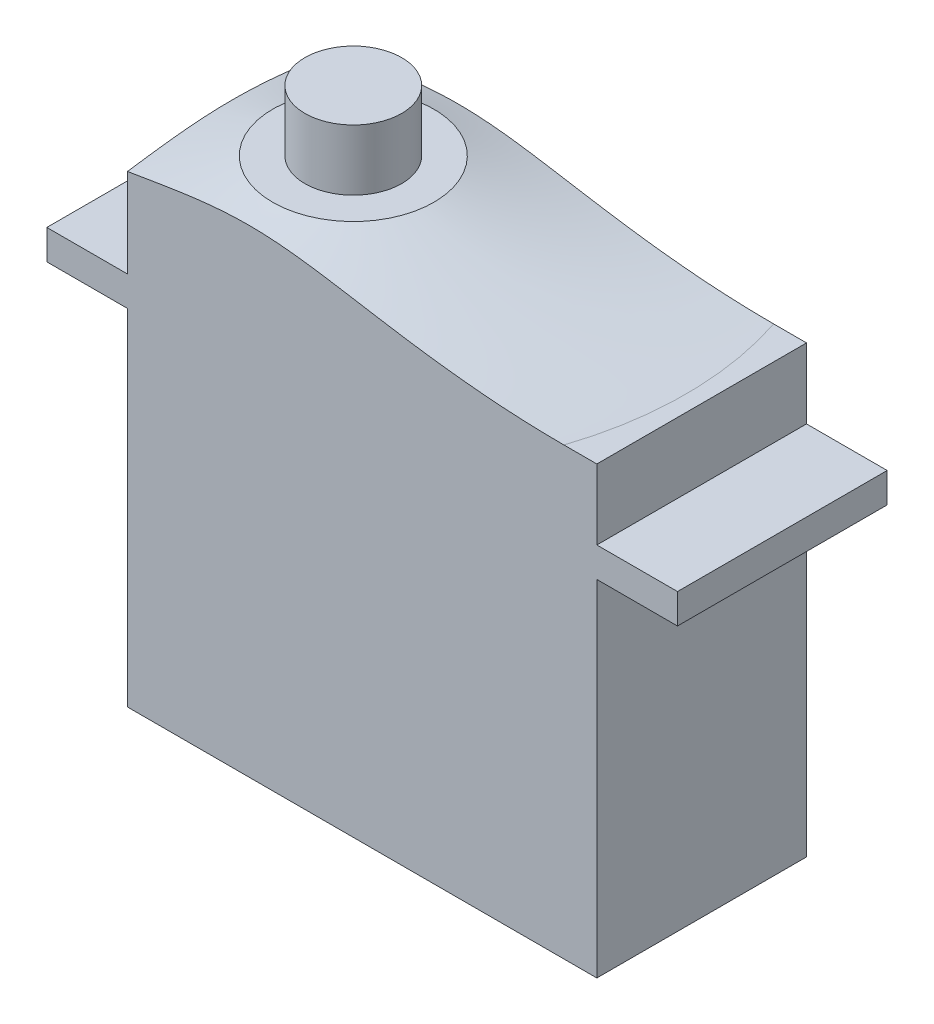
ISO-10303-21;
HEADER;
FILE_DESCRIPTION(('STEP AP214'),'2;1');
FILE_NAME('part.step','',(''),(''),'','','');
FILE_SCHEMA(('AUTOMOTIVE_DESIGN { 1 0 10303 214 1 1 1 1 }'));
ENDSEC;
DATA;
#1=APPLICATION_CONTEXT('core data for automotive mechanical design processes');
#2=APPLICATION_PROTOCOL_DEFINITION('international standard','automotive_design',2000,#1);
#3=PRODUCT_CONTEXT('',#1,'mechanical');
#4=PRODUCT('Part','Part','',(#3));
#5=PRODUCT_RELATED_PRODUCT_CATEGORY('part','',(#4));
#6=PRODUCT_DEFINITION_FORMATION('','',#4);
#7=PRODUCT_DEFINITION_CONTEXT('part definition',#1,'design');
#8=PRODUCT_DEFINITION('design','',#6,#7);
#9=PRODUCT_DEFINITION_SHAPE('','',#8);
#10=(LENGTH_UNIT() NAMED_UNIT(*) SI_UNIT(.MILLI.,.METRE.));
#11=(NAMED_UNIT(*) PLANE_ANGLE_UNIT() SI_UNIT($,.RADIAN.));
#12=(NAMED_UNIT(*) SI_UNIT($,.STERADIAN.) SOLID_ANGLE_UNIT());
#13=UNCERTAINTY_MEASURE_WITH_UNIT(LENGTH_MEASURE(1.E-05),#10,'distance_accuracy_value','');
#14=(GEOMETRIC_REPRESENTATION_CONTEXT(3) GLOBAL_UNCERTAINTY_ASSIGNED_CONTEXT((#13)) GLOBAL_UNIT_ASSIGNED_CONTEXT((#10,
#11,#12)) REPRESENTATION_CONTEXT('',''));
#15=CARTESIAN_POINT('',(0.,0.,0.));
#16=DIRECTION('',(0.,0.,1.));
#17=DIRECTION('',(1.,0.,0.));
#18=AXIS2_PLACEMENT_3D('',#15,#16,#17);
#19=CARTESIAN_POINT('',(0.,27.6,0.));
#20=DIRECTION('',(1.,0.,0.));
#21=DIRECTION('',(0.,0.,-1.));
#22=AXIS2_PLACEMENT_3D('',#19,#20,#21);
#23=PLANE('',#22);
#24=DIRECTION('',(0.,0.,1.));
#25=VECTOR('',#24,1.);
#26=CARTESIAN_POINT('',(0.,21.4,13.));
#27=LINE('',#26,#25);
#28=CARTESIAN_POINT('',(0.,21.4,0.));
#29=VERTEX_POINT('',#28);
#30=CARTESIAN_POINT('',(0.,21.4,13.));
#31=VERTEX_POINT('',#30);
#32=EDGE_CURVE('E150',#29,#31,#27,.T.);
#33=ORIENTED_EDGE('',*,*,#32,.F.);
#34=DIRECTION('',(0.,-1.,0.));
#35=VECTOR('',#34,1.);
#36=CARTESIAN_POINT('',(0.,27.6,0.));
#37=LINE('',#36,#35);
#38=CARTESIAN_POINT('',(0.,0.,0.));
#39=VERTEX_POINT('',#38);
#40=EDGE_CURVE('E195',#29,#39,#37,.T.);
#41=ORIENTED_EDGE('',*,*,#40,.T.);
#42=DIRECTION('',(0.,0.,1.));
#43=VECTOR('',#42,1.);
#44=CARTESIAN_POINT('',(0.,0.,0.));
#45=LINE('',#44,#43);
#46=CARTESIAN_POINT('',(0.,0.,13.));
#47=VERTEX_POINT('',#46);
#48=EDGE_CURVE('E186',#39,#47,#45,.T.);
#49=ORIENTED_EDGE('',*,*,#48,.T.);
#50=DIRECTION('',(0.,-1.,0.));
#51=VECTOR('',#50,1.);
#52=CARTESIAN_POINT('',(0.,27.6,13.));
#53=LINE('',#52,#51);
#54=EDGE_CURVE('E213',#31,#47,#53,.T.);
#55=ORIENTED_EDGE('',*,*,#54,.F.);
#56=EDGE_LOOP('',(#33,#41,#49,#55));
#57=FACE_BOUND('',#56,.T.);
#58=ADVANCED_FACE('F32',(#57),#23,.F.);
#59=DIRECTION('',(0.,0.,-1.));
#60=VECTOR('',#59,1.);
#61=CARTESIAN_POINT('',(0.,23.25,13.));
#62=LINE('',#61,#60);
#63=CARTESIAN_POINT('',(0.,23.25,13.));
#64=VERTEX_POINT('',#63);
#65=CARTESIAN_POINT('',(0.,23.25,0.));
#66=VERTEX_POINT('',#65);
#67=EDGE_CURVE('E244',#64,#66,#62,.T.);
#68=ORIENTED_EDGE('',*,*,#67,.F.);
#69=CARTESIAN_POINT('',(0.,28.7556411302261,13.));
#70=VERTEX_POINT('',#69);
#71=EDGE_CURVE('E58',#70,#64,#53,.T.);
#72=ORIENTED_EDGE('',*,*,#71,.F.);
#73=CARTESIAN_POINT('',(0.,28.7556411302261,13.));
#74=CARTESIAN_POINT('',(0.,28.7857035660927,12.7901635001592));
#75=CARTESIAN_POINT('',(0.,28.8155636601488,12.5802963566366));
#76=CARTESIAN_POINT('',(0.,28.8744237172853,12.1604329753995));
#77=CARTESIAN_POINT('',(0.,28.9034236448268,11.950436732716));
#78=CARTESIAN_POINT('',(0.,28.9601264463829,11.5301083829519));
#79=CARTESIAN_POINT('',(0.,28.9878283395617,11.3197761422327));
#80=CARTESIAN_POINT('',(0.,29.0413944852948,10.8988804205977));
#81=CARTESIAN_POINT('',(0.,29.0672587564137,10.6883169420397));
#82=CARTESIAN_POINT('',(0.,29.141272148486,10.0562491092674));
#83=CARTESIAN_POINT('',(0.,29.1858495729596,9.63431221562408));
#84=CARTESIAN_POINT('',(0.,29.2608840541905,8.7892397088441));
#85=CARTESIAN_POINT('',(0.,29.2913450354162,8.36610446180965));
#86=CARTESIAN_POINT('',(0.,29.3235052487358,7.73272580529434));
#87=CARTESIAN_POINT('',(0.,29.3319614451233,7.52281839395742));
#88=CARTESIAN_POINT('',(0.,29.3442110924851,7.1028646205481));
#89=CARTESIAN_POINT('',(0.,29.3480045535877,6.89281825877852));
#90=CARTESIAN_POINT('',(0.,29.3507860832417,6.47268395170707));
#91=CARTESIAN_POINT('',(0.,29.3497739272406,6.26259600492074));
#92=CARTESIAN_POINT('',(0.,29.3429822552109,5.84249786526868));
#93=CARTESIAN_POINT('',(0.,29.3372027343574,5.63248767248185));
#94=CARTESIAN_POINT('',(0.,29.3210859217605,5.21277980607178));
#95=CARTESIAN_POINT('',(0.,29.3107515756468,5.00308201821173));
#96=CARTESIAN_POINT('',(0.,29.2858772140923,4.58393376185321));
#97=CARTESIAN_POINT('',(0.,29.2713370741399,4.37448330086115));
#98=CARTESIAN_POINT('',(0.,29.2220820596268,3.7465824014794));
#99=CARTESIAN_POINT('',(0.,29.1817321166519,3.32857127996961));
#100=CARTESIAN_POINT('',(0.,29.1094233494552,2.66833941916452));
#101=CARTESIAN_POINT('',(0.,29.0810120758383,2.42570869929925));
#102=CARTESIAN_POINT('',(0.,29.0214251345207,1.94079407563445));
#103=CARTESIAN_POINT('',(0.,28.9902495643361,1.69851015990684));
#104=CARTESIAN_POINT('',(0.,28.9258395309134,1.2134199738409));
#105=CARTESIAN_POINT('',(0.,28.8925987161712,0.970614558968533));
#106=CARTESIAN_POINT('',(0.,28.8248730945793,0.485192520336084));
#107=CARTESIAN_POINT('',(0.,28.790388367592,0.242575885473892));
#108=CARTESIAN_POINT('',(0.,28.7556411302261,0.));
#109=B_SPLINE_CURVE_WITH_KNOTS('',3,(#73,#74,#75,#76,#77,#78,#79,#80,#81,#82,#83,#84,#85,#86,
#87,#88,#89,#90,#91,#92,#93,#94,#95,#96,#97,#98,#99,#100,#101,#102,#103,#104,#105,#106,#107,
#108),.UNSPECIFIED.,.F.,.F.,(4,2,2,2,2,2,2,2,2,2,2,2,2,2,2,2,2,4),(0.,0.635939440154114,
1.27190511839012,1.90834384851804,2.54477614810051,3.81747373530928,5.08981729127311,
5.72000540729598,6.35019215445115,6.9804083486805,7.6106251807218,8.24043504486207,
8.87026355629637,10.1298870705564,10.862742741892,11.5955725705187,12.3307799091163,
13.0659401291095),.UNSPECIFIED.);
#110=CARTESIAN_POINT('',(0.,28.7556411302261,0.));
#111=VERTEX_POINT('',#110);
#112=EDGE_CURVE('E45',#70,#111,#109,.T.);
#113=ORIENTED_EDGE('',*,*,#112,.T.);
#114=EDGE_CURVE('E51',#111,#66,#37,.T.);
#115=ORIENTED_EDGE('',*,*,#114,.T.);
#116=EDGE_LOOP('',(#68,#72,#113,#115));
#117=FACE_BOUND('',#116,.T.);
#118=ADVANCED_FACE('F234',(#117),#23,.F.);
#119=CARTESIAN_POINT('',(29.1,27.6,0.));
#120=DIRECTION('',(1.,0.,0.));
#121=DIRECTION('',(0.,0.,-1.));
#122=AXIS2_PLACEMENT_3D('',#119,#120,#121);
#123=PLANE('',#122);
#124=DIRECTION('',(0.,0.,1.));
#125=VECTOR('',#124,1.);
#126=CARTESIAN_POINT('',(29.1,23.25,13.));
#127=LINE('',#126,#125);
#128=CARTESIAN_POINT('',(29.1,23.25,0.));
#129=VERTEX_POINT('',#128);
#130=CARTESIAN_POINT('',(29.1,23.25,13.));
#131=VERTEX_POINT('',#130);
#132=EDGE_CURVE('E157',#129,#131,#127,.T.);
#133=ORIENTED_EDGE('',*,*,#132,.F.);
#134=DIRECTION('',(0.,-1.,0.));
#135=VECTOR('',#134,1.);
#136=CARTESIAN_POINT('',(29.1,27.6,0.));
#137=LINE('',#136,#135);
#138=CARTESIAN_POINT('',(29.1,27.6,0.));
#139=VERTEX_POINT('',#138);
#140=EDGE_CURVE('E207',#139,#129,#137,.T.);
#141=ORIENTED_EDGE('',*,*,#140,.F.);
#142=DIRECTION('',(0.,0.,1.));
#143=VECTOR('',#142,1.);
#144=CARTESIAN_POINT('',(29.1,27.6,0.));
#145=LINE('',#144,#143);
#146=CARTESIAN_POINT('',(29.1,27.6,13.));
#147=VERTEX_POINT('',#146);
#148=EDGE_CURVE('E189',#139,#147,#145,.T.);
#149=ORIENTED_EDGE('',*,*,#148,.T.);
#150=DIRECTION('',(0.,-1.,0.));
#151=VECTOR('',#150,1.);
#152=CARTESIAN_POINT('',(29.1,27.6,13.));
#153=LINE('',#152,#151);
#154=EDGE_CURVE('E211',#147,#131,#153,.T.);
#155=ORIENTED_EDGE('',*,*,#154,.T.);
#156=EDGE_LOOP('',(#133,#141,#149,#155));
#157=FACE_BOUND('',#156,.T.);
#158=ADVANCED_FACE('F231',(#157),#123,.T.);
#159=CARTESIAN_POINT('',(0.,27.6,13.));
#160=DIRECTION('',(0.,0.,-1.));
#161=DIRECTION('',(-1.,0.,0.));
#162=AXIS2_PLACEMENT_3D('',#159,#160,#161);
#163=PLANE('',#162);
#164=DIRECTION('',(1.,0.,0.));
#165=VECTOR('',#164,1.);
#166=CARTESIAN_POINT('',(0.,0.,13.));
#167=LINE('',#166,#165);
#168=CARTESIAN_POINT('',(29.1,0.,13.));
#169=VERTEX_POINT('',#168);
#170=EDGE_CURVE('E198',#47,#169,#167,.T.);
#171=ORIENTED_EDGE('',*,*,#170,.T.);
#172=CARTESIAN_POINT('',(29.1,21.4,13.));
#173=VERTEX_POINT('',#172);
#174=EDGE_CURVE('E210',#173,#169,#153,.T.);
#175=ORIENTED_EDGE('',*,*,#174,.F.);
#176=DIRECTION('',(-1.,0.,0.));
#177=VECTOR('',#176,1.);
#178=CARTESIAN_POINT('',(34.1,21.4,13.));
#179=LINE('',#178,#177);
#180=CARTESIAN_POINT('',(34.1,21.4,13.));
#181=VERTEX_POINT('',#180);
#182=EDGE_CURVE('E183',#181,#173,#179,.T.);
#183=ORIENTED_EDGE('',*,*,#182,.F.);
#184=DIRECTION('',(0.,-1.,0.));
#185=VECTOR('',#184,1.);
#186=CARTESIAN_POINT('',(34.1,21.4,13.));
#187=LINE('',#186,#185);
#188=CARTESIAN_POINT('',(34.1,23.25,13.));
#189=VERTEX_POINT('',#188);
#190=EDGE_CURVE('E163',#189,#181,#187,.T.);
#191=ORIENTED_EDGE('',*,*,#190,.F.);
#192=DIRECTION('',(-1.,0.,0.));
#193=VECTOR('',#192,1.);
#194=CARTESIAN_POINT('',(34.1,23.25,13.));
#195=LINE('',#194,#193);
#196=EDGE_CURVE('E171',#189,#131,#195,.T.);
#197=ORIENTED_EDGE('',*,*,#196,.T.);
#198=ORIENTED_EDGE('',*,*,#154,.F.);
#199=DIRECTION('',(1.,0.,0.));
#200=VECTOR('',#199,1.);
#201=CARTESIAN_POINT('',(0.,27.6,13.));
#202=LINE('',#201,#200);
#203=CARTESIAN_POINT('',(27.0608013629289,27.6,13.));
#204=VERTEX_POINT('',#203);
#205=EDGE_CURVE('E187',#204,#147,#202,.T.);
#206=ORIENTED_EDGE('',*,*,#205,.F.);
#207=CARTESIAN_POINT('',(27.0608013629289,27.6,13.));
#208=CARTESIAN_POINT('',(26.6509079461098,27.5999909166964,13.));
#209=CARTESIAN_POINT('',(26.2410197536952,27.6045384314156,13.));
#210=CARTESIAN_POINT('',(25.4214464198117,27.6225151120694,13.));
#211=CARTESIAN_POINT('',(25.011761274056,27.6359440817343,13.));
#212=CARTESIAN_POINT('',(24.1936005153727,27.6714160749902,13.));
#213=CARTESIAN_POINT('',(23.7851241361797,27.6934415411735,13.));
#214=CARTESIAN_POINT('',(22.9687099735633,27.7457992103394,13.));
#215=CARTESIAN_POINT('',(22.5607721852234,27.7761313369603,13.));
#216=CARTESIAN_POINT('',(21.7459042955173,27.8446854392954,13.));
#217=CARTESIAN_POINT('',(21.338973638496,27.8829008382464,13.));
#218=CARTESIAN_POINT('',(20.5258593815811,27.9667392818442,13.));
#219=CARTESIAN_POINT('',(20.1196758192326,28.0123626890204,13.));
#220=CARTESIAN_POINT('',(19.3074719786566,28.1104452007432,13.));
#221=CARTESIAN_POINT('',(18.9014530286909,28.1629152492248,13.));
#222=CARTESIAN_POINT('',(18.0903028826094,28.2737649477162,13.));
#223=CARTESIAN_POINT('',(17.685171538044,28.3321435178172,13.));
#224=CARTESIAN_POINT('',(16.9222167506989,28.446672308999,13.));
#225=CARTESIAN_POINT('',(16.5643151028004,28.5023056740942,13.));
#226=CARTESIAN_POINT('',(15.8489366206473,28.616244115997,13.));
#227=CARTESIAN_POINT('',(15.4914597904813,28.6745492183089,13.));
#228=CARTESIAN_POINT('',(14.7764240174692,28.7924906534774,13.));
#229=CARTESIAN_POINT('',(14.4188652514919,28.8521280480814,13.));
#230=CARTESIAN_POINT('',(13.7036540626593,28.9708527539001,13.));
#231=CARTESIAN_POINT('',(13.3460016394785,29.0299400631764,13.));
#232=CARTESIAN_POINT('',(12.6315750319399,29.1449494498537,13.));
#233=CARTESIAN_POINT('',(12.2748026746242,29.2008827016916,13.));
#234=CARTESIAN_POINT('',(11.5603505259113,29.3068186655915,13.));
#235=CARTESIAN_POINT('',(11.202670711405,29.3568212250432,13.));
#236=CARTESIAN_POINT('',(10.4868005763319,29.4472093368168,13.));
#237=CARTESIAN_POINT('',(10.1286127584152,29.4876141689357,13.));
#238=CARTESIAN_POINT('',(9.41097531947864,29.5551527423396,13.));
#239=CARTESIAN_POINT('',(9.05152581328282,29.5822876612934,13.));
#240=CARTESIAN_POINT('',(8.33252113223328,29.6201028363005,13.));
#241=CARTESIAN_POINT('',(7.97296794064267,29.6308192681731,13.));
#242=CARTESIAN_POINT('',(7.25377206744,29.6345073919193,13.));
#243=CARTESIAN_POINT('',(6.89412938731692,29.6274793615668,13.));
#244=CARTESIAN_POINT('',(6.17458424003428,29.5965679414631,13.));
#245=CARTESIAN_POINT('',(5.81468390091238,29.5726370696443,13.));
#246=CARTESIAN_POINT('',(5.09610201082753,29.510742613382,13.));
#247=CARTESIAN_POINT('',(4.73742058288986,29.4727776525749,13.));
#248=CARTESIAN_POINT('',(4.01171140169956,29.3853992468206,13.));
#249=CARTESIAN_POINT('',(3.64471838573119,29.3357055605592,13.));
#250=CARTESIAN_POINT('',(2.91174354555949,29.2294311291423,13.));
#251=CARTESIAN_POINT('',(2.54576175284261,29.1728501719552,13.));
#252=CARTESIAN_POINT('',(1.8163868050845,29.0564883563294,13.));
#253=CARTESIAN_POINT('',(1.45299050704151,28.9967268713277,13.));
#254=CARTESIAN_POINT('',(0.908047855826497,28.9064275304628,13.));
#255=CARTESIAN_POINT('',(0.726445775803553,28.8762216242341,13.));
#256=CARTESIAN_POINT('',(0.363237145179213,28.8158429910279,13.));
#257=CARTESIAN_POINT('',(0.18163059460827,28.7856702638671,13.));
#258=CARTESIAN_POINT('',(0.,28.7556411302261,13.));
#259=B_SPLINE_CURVE_WITH_KNOTS('',3,(#207,#208,#209,#210,#211,#212,#213,#214,#215,#216,#217,
#218,#219,#220,#221,#222,#223,#224,#225,#226,#227,#228,#229,#230,#231,#232,#233,#234,#235,#236,
#237,#238,#239,#240,#241,#242,#243,#244,#245,#246,#247,#248,#249,#250,#251,#252,#253,#254,#255,
#256,#257,#258),.UNSPECIFIED.,.F.,.F.,(4,2,2,2,2,2,2,2,2,2,2,2,2,2,2,2,2,2,2,2,2,2,2,2,2,4),(0.,
1.22964720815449,2.45926724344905,3.68638894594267,4.91349936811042,6.13959016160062,
7.36574097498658,8.59387628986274,9.82178754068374,10.9083728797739,11.9949685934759,
13.0824635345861,14.1699623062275,15.2533286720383,16.3367229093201,17.4179220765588,
18.4990252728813,19.5777429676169,20.6564437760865,21.7381868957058,22.8200361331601,
23.9309582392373,25.0419145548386,26.146742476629,26.6990337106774,27.2513218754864),.UNSPECIFIED.);
#260=EDGE_CURVE('E219',#204,#70,#259,.T.);
#261=ORIENTED_EDGE('',*,*,#260,.T.);
#262=ORIENTED_EDGE('',*,*,#71,.T.);
#263=DIRECTION('',(1.,0.,0.));
#264=VECTOR('',#263,1.);
#265=CARTESIAN_POINT('',(-5.,23.25,13.));
#266=LINE('',#265,#264);
#267=CARTESIAN_POINT('',(-5.,23.25,13.));
#268=VERTEX_POINT('',#267);
#269=EDGE_CURVE('E136',#268,#64,#266,.T.);
#270=ORIENTED_EDGE('',*,*,#269,.F.);
#271=DIRECTION('',(0.,1.,0.));
#272=VECTOR('',#271,1.);
#273=CARTESIAN_POINT('',(-5.,21.4,13.));
#274=LINE('',#273,#272);
#275=CARTESIAN_POINT('',(-5.,21.4,13.));
#276=VERTEX_POINT('',#275);
#277=EDGE_CURVE('E141',#276,#268,#274,.T.);
#278=ORIENTED_EDGE('',*,*,#277,.F.);
#279=DIRECTION('',(1.,0.,0.));
#280=VECTOR('',#279,1.);
#281=CARTESIAN_POINT('',(-5.,21.4,13.));
#282=LINE('',#281,#280);
#283=EDGE_CURVE('E250',#276,#31,#282,.T.);
#284=ORIENTED_EDGE('',*,*,#283,.T.);
#285=ORIENTED_EDGE('',*,*,#54,.T.);
#286=EDGE_LOOP('',(#171,#175,#183,#191,#197,#198,#206,#261,#262,#270,#278,#284,#285));
#287=FACE_BOUND('',#286,.T.);
#288=ADVANCED_FACE('F153',(#287),#163,.F.);
#289=DIRECTION('',(0.,0.,-1.));
#290=VECTOR('',#289,1.);
#291=CARTESIAN_POINT('',(29.1,21.4,13.));
#292=LINE('',#291,#290);
#293=CARTESIAN_POINT('',(29.1,21.4,0.));
#294=VERTEX_POINT('',#293);
#295=EDGE_CURVE('E154',#173,#294,#292,.T.);
#296=ORIENTED_EDGE('',*,*,#295,.F.);
#297=ORIENTED_EDGE('',*,*,#174,.T.);
#298=DIRECTION('',(0.,0.,1.));
#299=VECTOR('',#298,1.);
#300=CARTESIAN_POINT('',(29.1,0.,0.));
#301=LINE('',#300,#299);
#302=CARTESIAN_POINT('',(29.1,0.,0.));
#303=VERTEX_POINT('',#302);
#304=EDGE_CURVE('E200',#303,#169,#301,.T.);
#305=ORIENTED_EDGE('',*,*,#304,.F.);
#306=EDGE_CURVE('E206',#294,#303,#137,.T.);
#307=ORIENTED_EDGE('',*,*,#306,.F.);
#308=EDGE_LOOP('',(#296,#297,#305,#307));
#309=FACE_BOUND('',#308,.T.);
#310=ADVANCED_FACE('F230',(#309),#123,.T.);
#311=CARTESIAN_POINT('',(0.,27.6,0.));
#312=DIRECTION('',(0.,0.,-1.));
#313=DIRECTION('',(-1.,0.,0.));
#314=AXIS2_PLACEMENT_3D('',#311,#312,#313);
#315=PLANE('',#314);
#316=DIRECTION('',(1.,0.,0.));
#317=VECTOR('',#316,1.);
#318=CARTESIAN_POINT('',(0.,0.,0.));
#319=LINE('',#318,#317);
#320=EDGE_CURVE('E190',#39,#303,#319,.T.);
#321=ORIENTED_EDGE('',*,*,#320,.F.);
#322=ORIENTED_EDGE('',*,*,#40,.F.);
#323=DIRECTION('',(1.,0.,0.));
#324=VECTOR('',#323,1.);
#325=CARTESIAN_POINT('',(-5.,21.4,0.));
#326=LINE('',#325,#324);
#327=CARTESIAN_POINT('',(-5.,21.4,0.));
#328=VERTEX_POINT('',#327);
#329=EDGE_CURVE('E159',#328,#29,#326,.T.);
#330=ORIENTED_EDGE('',*,*,#329,.F.);
#331=DIRECTION('',(0.,-1.,0.));
#332=VECTOR('',#331,1.);
#333=CARTESIAN_POINT('',(-5.,21.4,0.));
#334=LINE('',#333,#332);
#335=CARTESIAN_POINT('',(-5.,23.25,0.));
#336=VERTEX_POINT('',#335);
#337=EDGE_CURVE('E140',#336,#328,#334,.T.);
#338=ORIENTED_EDGE('',*,*,#337,.F.);
#339=DIRECTION('',(1.,0.,0.));
#340=VECTOR('',#339,1.);
#341=CARTESIAN_POINT('',(-5.,23.25,0.));
#342=LINE('',#341,#340);
#343=EDGE_CURVE('E137',#336,#66,#342,.T.);
#344=ORIENTED_EDGE('',*,*,#343,.T.);
#345=ORIENTED_EDGE('',*,*,#114,.F.);
#346=CARTESIAN_POINT('',(0.,28.7556411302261,0.));
#347=CARTESIAN_POINT('',(0.208102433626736,28.7900410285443,0.));
#348=CARTESIAN_POINT('',(0.416172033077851,28.8246381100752,0.));
#349=CARTESIAN_POINT('',(0.83231472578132,28.8938264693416,0.));
#350=CARTESIAN_POINT('',(1.04038781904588,28.9284177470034,0.));
#351=CARTESIAN_POINT('',(1.45670184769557,28.9972100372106,0.));
#352=CARTESIAN_POINT('',(1.66494281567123,29.031410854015,0.));
#353=CARTESIAN_POINT('',(2.08156979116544,29.0989142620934,0.));
#354=CARTESIAN_POINT('',(2.28995579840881,29.1322168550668,0.));
#355=CARTESIAN_POINT('',(2.91580772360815,29.2300250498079,0.));
#356=CARTESIAN_POINT('',(3.33361783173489,29.2923714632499,0.));
#357=CARTESIAN_POINT('',(4.17077635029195,29.4059618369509,0.));
#358=CARTESIAN_POINT('',(4.59012461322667,29.4572068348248,0.));
#359=CARTESIAN_POINT('',(5.22002696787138,29.5211553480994,0.));
#360=CARTESIAN_POINT('',(5.42992333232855,29.5403051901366,0.));
#361=CARTESIAN_POINT('',(5.85010658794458,29.5736322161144,0.));
#362=CARTESIAN_POINT('',(6.0603934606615,29.587809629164,0.));
#363=CARTESIAN_POINT('',(6.48123541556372,29.6106114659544,0.));
#364=CARTESIAN_POINT('',(6.69179044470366,29.619236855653,0.));
#365=CARTESIAN_POINT('',(7.11306127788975,29.6305591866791,0.));
#366=CARTESIAN_POINT('',(7.32377708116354,29.6332561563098,0.));
#367=CARTESIAN_POINT('',(7.7449389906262,29.6325987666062,0.));
#368=CARTESIAN_POINT('',(7.95538510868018,29.6292518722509,0.));
#369=CARTESIAN_POINT('',(8.37610001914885,29.6166736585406,0.));
#370=CARTESIAN_POINT('',(8.58636881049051,29.6074423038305,0.));
#371=CARTESIAN_POINT('',(9.00662339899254,29.5834957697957,0.));
#372=CARTESIAN_POINT('',(9.21660914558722,29.5687797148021,0.));
#373=CARTESIAN_POINT('',(9.63618367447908,29.5344567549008,0.));
#374=CARTESIAN_POINT('',(9.84577243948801,29.514849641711,0.));
#375=CARTESIAN_POINT('',(10.406718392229,29.4567123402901,0.));
#376=CARTESIAN_POINT('',(10.7576790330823,29.4143745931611,0.));
#377=CARTESIAN_POINT('',(11.4585055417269,29.3214493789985,0.));
#378=CARTESIAN_POINT('',(11.8083712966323,29.2708610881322,0.));
#379=CARTESIAN_POINT('',(12.5074427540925,29.1646834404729,0.));
#380=CARTESIAN_POINT('',(12.8566482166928,29.1090925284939,0.));
#381=CARTESIAN_POINT('',(13.5546663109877,28.9956171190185,0.));
#382=CARTESIAN_POINT('',(13.9034789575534,28.9377327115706,0.));
#383=CARTESIAN_POINT('',(14.60194561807,28.8216402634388,0.));
#384=CARTESIAN_POINT('',(14.9515995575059,28.763431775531,0.));
#385=CARTESIAN_POINT('',(15.6511508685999,28.6484737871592,0.));
#386=CARTESIAN_POINT('',(16.0010482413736,28.591724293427,0.));
#387=CARTESIAN_POINT('',(16.7011991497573,28.4809482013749,0.));
#388=CARTESIAN_POINT('',(17.0514525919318,28.426921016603,0.));
#389=CARTESIAN_POINT('',(17.7525074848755,28.3225337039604,0.));
#390=CARTESIAN_POINT('',(18.1033089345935,28.272173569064,0.));
#391=CARTESIAN_POINT('',(18.8101117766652,28.1752300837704,0.));
#392=CARTESIAN_POINT('',(19.1661211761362,28.1287047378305,0.));
#393=CARTESIAN_POINT('',(19.8787710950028,28.0407690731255,0.));
#394=CARTESIAN_POINT('',(20.2354116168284,27.9993587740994,0.));
#395=CARTESIAN_POINT('',(21.3062635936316,27.8835252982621,0.));
#396=CARTESIAN_POINT('',(22.0214088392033,27.8174990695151,0.));
#397=CARTESIAN_POINT('',(23.4566520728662,27.7102973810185,0.));
#398=CARTESIAN_POINT('',(24.1767581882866,27.6692288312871,0.));
#399=CARTESIAN_POINT('',(25.2577540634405,27.6278640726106,0.));
#400=CARTESIAN_POINT('',(25.6182762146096,27.6174487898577,0.));
#401=CARTESIAN_POINT('',(26.3394626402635,27.6035150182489,0.));
#402=CARTESIAN_POINT('',(26.7001269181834,27.5999967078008,0.));
#403=CARTESIAN_POINT('',(27.0608013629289,27.6,0.));
#404=B_SPLINE_CURVE_WITH_KNOTS('',3,(#346,#347,#348,#349,#350,#351,#352,#353,#354,#355,#356,
#357,#358,#359,#360,#361,#362,#363,#364,#365,#366,#367,#368,#369,#370,#371,#372,#373,#374,#375,
#376,#377,#378,#379,#380,#381,#382,#383,#384,#385,#386,#387,#388,#389,#390,#391,#392,#393,#394,
#395,#396,#397,#398,#399,#400,#401,#402,#403),.UNSPECIFIED.,.F.,.F.,(4,2,2,2,2,2,2,2,2,2,2,2,2,
2,2,2,2,2,2,2,2,2,2,2,2,2,2,2,4),(0.,0.632779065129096,1.26556562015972,1.89865657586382,
2.53174633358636,3.79899005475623,5.06611527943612,5.69837016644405,6.33059591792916,
6.96271164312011,7.59482435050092,8.22615684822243,8.85749313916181,9.48893027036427,
10.1203942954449,11.1807474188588,12.2412064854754,13.3019963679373,14.3627446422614,
15.4261422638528,16.4895447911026,17.5527172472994,18.6158876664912,19.692961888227,
20.7700402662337,22.9241867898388,25.0874970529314,26.169456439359,27.2514438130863),.UNSPECIFIED.);
#405=CARTESIAN_POINT('',(27.0608013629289,27.6,0.));
#406=VERTEX_POINT('',#405);
#407=EDGE_CURVE('E11',#111,#406,#404,.T.);
#408=ORIENTED_EDGE('',*,*,#407,.T.);
#409=DIRECTION('',(1.,0.,0.));
#410=VECTOR('',#409,1.);
#411=CARTESIAN_POINT('',(0.,27.6,0.));
#412=LINE('',#411,#410);
#413=EDGE_CURVE('E193',#406,#139,#412,.T.);
#414=ORIENTED_EDGE('',*,*,#413,.T.);
#415=ORIENTED_EDGE('',*,*,#140,.T.);
#416=DIRECTION('',(-1.,0.,0.));
#417=VECTOR('',#416,1.);
#418=CARTESIAN_POINT('',(34.1,23.25,0.));
#419=LINE('',#418,#417);
#420=CARTESIAN_POINT('',(34.1,23.25,0.));
#421=VERTEX_POINT('',#420);
#422=EDGE_CURVE('E177',#421,#129,#419,.T.);
#423=ORIENTED_EDGE('',*,*,#422,.F.);
#424=DIRECTION('',(0.,1.,0.));
#425=VECTOR('',#424,1.);
#426=CARTESIAN_POINT('',(34.1,21.4,0.));
#427=LINE('',#426,#425);
#428=CARTESIAN_POINT('',(34.1,21.4,0.));
#429=VERTEX_POINT('',#428);
#430=EDGE_CURVE('E168',#429,#421,#427,.T.);
#431=ORIENTED_EDGE('',*,*,#430,.F.);
#432=DIRECTION('',(-1.,0.,0.));
#433=VECTOR('',#432,1.);
#434=CARTESIAN_POINT('',(34.1,21.4,0.));
#435=LINE('',#434,#433);
#436=EDGE_CURVE('E180',#429,#294,#435,.T.);
#437=ORIENTED_EDGE('',*,*,#436,.T.);
#438=ORIENTED_EDGE('',*,*,#306,.T.);
#439=EDGE_LOOP('',(#321,#322,#330,#338,#344,#345,#408,#414,#415,#423,#431,#437,#438));
#440=FACE_BOUND('',#439,.T.);
#441=ADVANCED_FACE('F248',(#440),#315,.T.);
#442=CARTESIAN_POINT('',(0.,27.6,0.));
#443=DIRECTION('',(0.,1.,0.));
#444=DIRECTION('',(0.,0.,1.));
#445=AXIS2_PLACEMENT_3D('',#442,#443,#444);
#446=PLANE('',#445);
#447=ORIENTED_EDGE('',*,*,#413,.F.);
#448=CARTESIAN_POINT('',(7.5,27.6,6.5));
#449=DIRECTION('',(0.,1.,0.));
#450=DIRECTION('',(0.,0.,1.));
#451=AXIS2_PLACEMENT_3D('',#448,#449,#450);
#452=CIRCLE('',#451,20.612494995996);
#453=EDGE_CURVE('E216',#406,#204,#452,.F.);
#454=ORIENTED_EDGE('',*,*,#453,.T.);
#455=ORIENTED_EDGE('',*,*,#205,.T.);
#456=ORIENTED_EDGE('',*,*,#148,.F.);
#457=EDGE_LOOP('',(#447,#454,#455,#456));
#458=FACE_BOUND('',#457,.T.);
#459=ADVANCED_FACE('F291',(#458),#446,.T.);
#460=CARTESIAN_POINT('',(0.,0.,0.));
#461=DIRECTION('',(0.,1.,0.));
#462=DIRECTION('',(0.,0.,1.));
#463=AXIS2_PLACEMENT_3D('',#460,#461,#462);
#464=PLANE('',#463);
#465=ORIENTED_EDGE('',*,*,#48,.F.);
#466=ORIENTED_EDGE('',*,*,#320,.T.);
#467=ORIENTED_EDGE('',*,*,#304,.T.);
#468=ORIENTED_EDGE('',*,*,#170,.F.);
#469=EDGE_LOOP('',(#465,#466,#467,#468));
#470=FACE_BOUND('',#469,.T.);
#471=ADVANCED_FACE('F314',(#470),#464,.F.);
#472=CARTESIAN_POINT('',(34.1,21.4,13.));
#473=DIRECTION('',(0.,1.,0.));
#474=DIRECTION('',(0.,0.,1.));
#475=AXIS2_PLACEMENT_3D('',#472,#473,#474);
#476=PLANE('',#475);
#477=ORIENTED_EDGE('',*,*,#295,.T.);
#478=ORIENTED_EDGE('',*,*,#436,.F.);
#479=DIRECTION('',(0.,0.,-1.));
#480=VECTOR('',#479,1.);
#481=CARTESIAN_POINT('',(34.1,21.4,13.));
#482=LINE('',#481,#480);
#483=EDGE_CURVE('E166',#181,#429,#482,.T.);
#484=ORIENTED_EDGE('',*,*,#483,.F.);
#485=ORIENTED_EDGE('',*,*,#182,.T.);
#486=EDGE_LOOP('',(#477,#478,#484,#485));
#487=FACE_BOUND('',#486,.T.);
#488=ADVANCED_FACE('F309',(#487),#476,.F.);
#489=CARTESIAN_POINT('',(34.1,23.25,13.));
#490=DIRECTION('',(0.,-1.,0.));
#491=DIRECTION('',(0.,0.,-1.));
#492=AXIS2_PLACEMENT_3D('',#489,#490,#491);
#493=PLANE('',#492);
#494=ORIENTED_EDGE('',*,*,#132,.T.);
#495=ORIENTED_EDGE('',*,*,#196,.F.);
#496=DIRECTION('',(0.,0.,1.));
#497=VECTOR('',#496,1.);
#498=CARTESIAN_POINT('',(34.1,23.25,13.));
#499=LINE('',#498,#497);
#500=EDGE_CURVE('E170',#421,#189,#499,.T.);
#501=ORIENTED_EDGE('',*,*,#500,.F.);
#502=ORIENTED_EDGE('',*,*,#422,.T.);
#503=EDGE_LOOP('',(#494,#495,#501,#502));
#504=FACE_BOUND('',#503,.T.);
#505=ADVANCED_FACE('F302',(#504),#493,.F.);
#506=CARTESIAN_POINT('',(34.1,0.,0.));
#507=DIRECTION('',(-1.,0.,0.));
#508=DIRECTION('',(0.,0.,1.));
#509=AXIS2_PLACEMENT_3D('',#506,#507,#508);
#510=PLANE('',#509);
#511=ORIENTED_EDGE('',*,*,#190,.T.);
#512=ORIENTED_EDGE('',*,*,#483,.T.);
#513=ORIENTED_EDGE('',*,*,#430,.T.);
#514=ORIENTED_EDGE('',*,*,#500,.T.);
#515=EDGE_LOOP('',(#511,#512,#513,#514));
#516=FACE_BOUND('',#515,.T.);
#517=ADVANCED_FACE('F304',(#516),#510,.F.);
#518=CARTESIAN_POINT('',(-5.,23.25,13.));
#519=DIRECTION('',(0.,-1.,0.));
#520=DIRECTION('',(0.,0.,-1.));
#521=AXIS2_PLACEMENT_3D('',#518,#519,#520);
#522=PLANE('',#521);
#523=ORIENTED_EDGE('',*,*,#67,.T.);
#524=ORIENTED_EDGE('',*,*,#343,.F.);
#525=DIRECTION('',(0.,0.,-1.));
#526=VECTOR('',#525,1.);
#527=CARTESIAN_POINT('',(-5.,23.25,13.));
#528=LINE('',#527,#526);
#529=EDGE_CURVE('E131',#268,#336,#528,.T.);
#530=ORIENTED_EDGE('',*,*,#529,.F.);
#531=ORIENTED_EDGE('',*,*,#269,.T.);
#532=EDGE_LOOP('',(#523,#524,#530,#531));
#533=FACE_BOUND('',#532,.T.);
#534=ADVANCED_FACE('F134',(#533),#522,.F.);
#535=CARTESIAN_POINT('',(-5.,21.4,13.));
#536=DIRECTION('',(0.,1.,0.));
#537=DIRECTION('',(0.,0.,1.));
#538=AXIS2_PLACEMENT_3D('',#535,#536,#537);
#539=PLANE('',#538);
#540=ORIENTED_EDGE('',*,*,#32,.T.);
#541=ORIENTED_EDGE('',*,*,#283,.F.);
#542=DIRECTION('',(0.,0.,1.));
#543=VECTOR('',#542,1.);
#544=CARTESIAN_POINT('',(-5.,21.4,13.));
#545=LINE('',#544,#543);
#546=EDGE_CURVE('E146',#328,#276,#545,.T.);
#547=ORIENTED_EDGE('',*,*,#546,.F.);
#548=ORIENTED_EDGE('',*,*,#329,.T.);
#549=EDGE_LOOP('',(#540,#541,#547,#548));
#550=FACE_BOUND('',#549,.T.);
#551=ADVANCED_FACE('F249',(#550),#539,.F.);
#552=CARTESIAN_POINT('',(-5.,0.,0.));
#553=DIRECTION('',(-1.,0.,0.));
#554=DIRECTION('',(0.,0.,1.));
#555=AXIS2_PLACEMENT_3D('',#552,#553,#554);
#556=PLANE('',#555);
#557=ORIENTED_EDGE('',*,*,#277,.T.);
#558=ORIENTED_EDGE('',*,*,#529,.T.);
#559=ORIENTED_EDGE('',*,*,#337,.T.);
#560=ORIENTED_EDGE('',*,*,#546,.T.);
#561=EDGE_LOOP('',(#557,#558,#559,#560));
#562=FACE_BOUND('',#561,.T.);
#563=ADVANCED_FACE('F144',(#562),#556,.T.);
#564=CARTESIAN_POINT('',(7.5,30.1,6.5));
#565=DIRECTION('',(0.,1.,0.));
#566=DIRECTION('',(0.,0.,1.));
#567=AXIS2_PLACEMENT_3D('',#564,#565,#566);
#568=PLANE('',#567);
#569=CARTESIAN_POINT('',(7.5,30.1,6.5));
#570=DIRECTION('',(0.,1.,0.));
#571=DIRECTION('',(0.,0.,1.));
#572=AXIS2_PLACEMENT_3D('',#569,#570,#571);
#573=CIRCLE('',#572,3.);
#574=CARTESIAN_POINT('',(7.5,30.1,9.5));
#575=VERTEX_POINT('',#574);
#576=EDGE_CURVE('E215',#575,#575,#573,.T.);
#577=ORIENTED_EDGE('',*,*,#576,.F.);
#578=EDGE_LOOP('',(#577));
#579=FACE_BOUND('',#578,.T.);
#580=CARTESIAN_POINT('',(7.5,30.1,6.5));
#581=DIRECTION('',(0.,1.,0.));
#582=DIRECTION('',(0.,0.,1.));
#583=AXIS2_PLACEMENT_3D('',#580,#581,#582);
#584=CIRCLE('',#583,5.);
#585=CARTESIAN_POINT('',(7.5,30.1,11.5));
#586=VERTEX_POINT('',#585);
#587=EDGE_CURVE('E254',#586,#586,#584,.T.);
#588=ORIENTED_EDGE('',*,*,#587,.T.);
#589=EDGE_LOOP('',(#588));
#590=FACE_BOUND('',#589,.T.);
#591=ADVANCED_FACE('F270',(#579,#590),#568,.T.);
#592=CARTESIAN_POINT('',(7.5,33.87,6.5));
#593=DIRECTION('',(0.,-1.,0.));
#594=DIRECTION('',(0.,0.,-1.));
#595=AXIS2_PLACEMENT_3D('',#592,#593,#594);
#596=CYLINDRICAL_SURFACE('',#595,3.);
#597=CARTESIAN_POINT('',(7.5,33.87,6.5));
#598=DIRECTION('',(0.,1.,0.));
#599=DIRECTION('',(0.,0.,1.));
#600=AXIS2_PLACEMENT_3D('',#597,#598,#599);
#601=CIRCLE('',#600,3.);
#602=CARTESIAN_POINT('',(7.5,33.87,9.5));
#603=VERTEX_POINT('',#602);
#604=EDGE_CURVE('E259',#603,#603,#601,.T.);
#605=ORIENTED_EDGE('',*,*,#604,.F.);
#606=EDGE_LOOP('',(#605));
#607=FACE_BOUND('',#606,.T.);
#608=ORIENTED_EDGE('',*,*,#576,.T.);
#609=EDGE_LOOP('',(#608));
#610=FACE_BOUND('',#609,.T.);
#611=ADVANCED_FACE('F267',(#607,#610),#596,.T.);
#612=CARTESIAN_POINT('',(7.5,33.87,6.5));
#613=DIRECTION('',(0.,1.,0.));
#614=DIRECTION('',(0.,0.,1.));
#615=AXIS2_PLACEMENT_3D('',#612,#613,#614);
#616=PLANE('',#615);
#617=ORIENTED_EDGE('',*,*,#604,.T.);
#618=EDGE_LOOP('',(#617));
#619=FACE_BOUND('',#618,.T.);
#620=ADVANCED_FACE('F265',(#619),#616,.T.);
#621=CARTESIAN_POINT('',(7.5,77.6,6.5));
#622=DIRECTION('',(0.,1.,0.));
#623=DIRECTION('',(0.,0.,1.));
#624=AXIS2_PLACEMENT_3D('',#621,#622,#623);
#625=DEGENERATE_TOROIDAL_SURFACE('',#624,20.612494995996,50.,.T.);
#626=ORIENTED_EDGE('',*,*,#260,.F.);
#627=ORIENTED_EDGE('',*,*,#453,.F.);
#628=ORIENTED_EDGE('',*,*,#407,.F.);
#629=ORIENTED_EDGE('',*,*,#112,.F.);
#630=EDGE_LOOP('',(#626,#627,#628,#629));
#631=FACE_BOUND('',#630,.T.);
#632=ORIENTED_EDGE('',*,*,#587,.F.);
#633=EDGE_LOOP('',(#632));
#634=FACE_BOUND('',#633,.T.);
#635=ADVANCED_FACE('F34',(#631,#634),#625,.F.);
#636=CLOSED_SHELL('',(#58,#118,#158,#288,#310,#441,#459,#471,#488,#505,#517,#534,#551,#563,#591,
#611,#620,#635));
#637=MANIFOLD_SOLID_BREP('B2',#636);
#638=ADVANCED_BREP_SHAPE_REPRESENTATION('',(#18,#637),#14);
#639=SHAPE_DEFINITION_REPRESENTATION(#9,#638);
ENDSEC;
END-ISO-10303-21;
